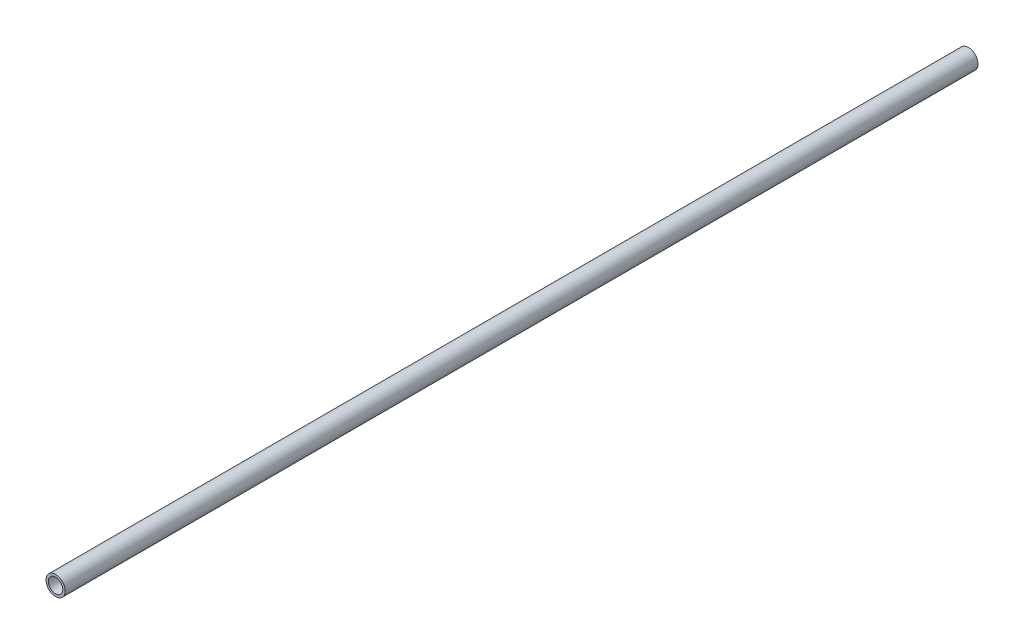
from build123d import *

# Parameters (mm, degrees)
ESQUISSE1_R        = 4
ESQUISSE1_R_2      = 3
EXTRU_MINCE1_DEPTH = 380


with BuildPart() as part:
    # Esquisse1 → Extru.-Mince1 (new body)
    with BuildSketch(Plane.XY):
        Circle(ESQUISSE1_R)
        Circle(ESQUISSE1_R_2, mode=Mode.SUBTRACT)
    extrude(amount=EXTRU_MINCE1_DEPTH)


solid = part.part
